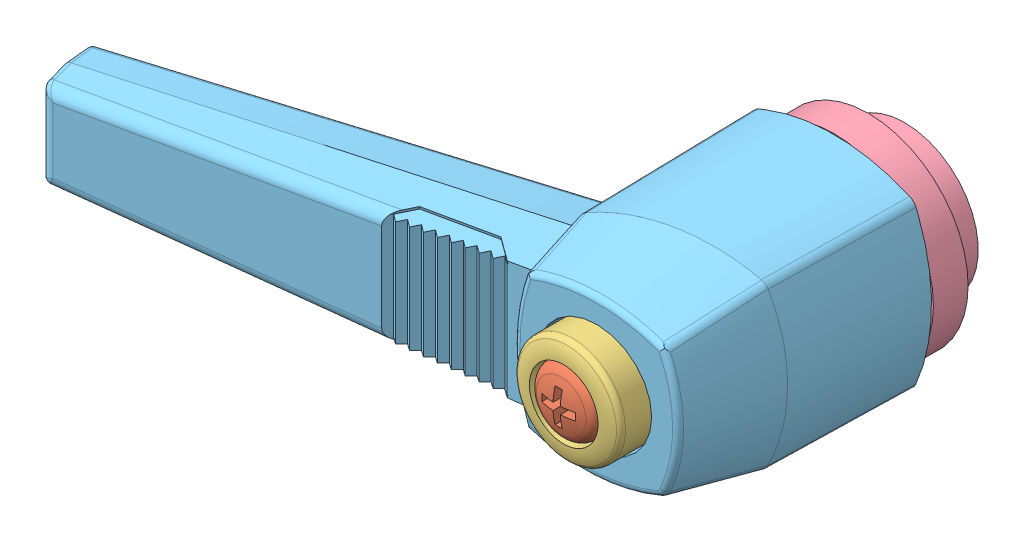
SolidWorks assembly 6355015.SLDASM, configuration Default (file format 8000). Lengths in mm.
Overall size (50.15 16.52 30.68).
5 component instances, 5 part files, 0 mates.
Components (placement in the parent):
- 6355015_01-1: 6355015_01.SLDPRT [Default] at origin size (8 8 13)
- 6355015_02-1: 6355015_02.SLDPRT [Default] at origin size (5.5 5.5 11.48)
- 6355015_03-1: 6355015_03.SLDPRT [Default] at origin size (8.8 8.81 4.5)
- 6355015_04-1: 6355015_04.SLDPRT [Default] at origin size (16.52 16.52 25.5)
- 6355015_05-1: 6355015_05.SLDPRT [Default] at origin size (49.99 16.39 24.9)
